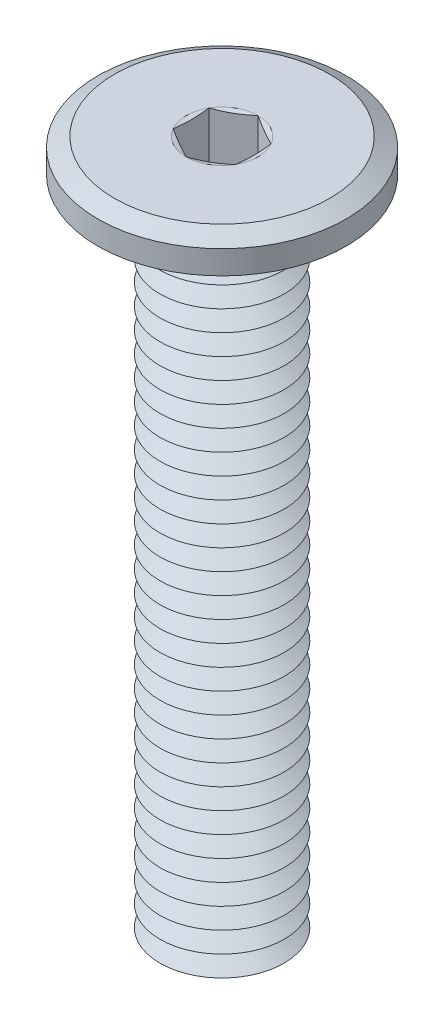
from build123d import *

# Parameters (mm, degrees)
SKETCH1_R           = 3
BOSS_EXTRUDE1_DEPTH = 0.8
SKETCH2_R           = 1.5
BOSS_EXTRUDE2_DEPTH = 16
LPATTERN1_COUNT     = 31
LPATTERN1_PITCH     = 0.5
FILLET1_R           = 0.1
CHAMFER2_SIZE       = 0.4
CHAMFER2_SIZE2      = 0.230940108
CUT_EXTRUDE1_DEPTH  = 1.4


with BuildPart() as part:
    # Sketch1 → Boss-Extrude1 (new body)
    with BuildSketch(Plane(origin=(0, 0, 0), x_dir=(1, 0, 0), z_dir=(0, 1, 0))):
        with Locations(Location((0, 0, 0), (0, 0, 270))):
            Circle(SKETCH1_R)
    extrude(amount=-BOSS_EXTRUDE1_DEPTH)

    # Sketch2 → Boss-Extrude2 (add)
    with BuildSketch(Plane.XZ.offset(0.8)):
        with Locations(Location((0, 0, 0), (0, 0, 270))):
            Circle(SKETCH2_R)
    extrude(amount=BOSS_EXTRUDE2_DEPTH)

    # Sketch5 → Cut-Revolve1 (revolve, cut)
    with BuildSketch(Plane(origin=(0, 0, 0), x_dir=(0, 0, -1), z_dir=(1, 0, 0))):
        Polygon((-1.5, -17.05), (-1.066987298, -16.8), (-1.5, -16.55), align=None)
    cut_revolve1 = revolve(axis=Axis((0, 0.990593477, 0), (0, -1, 0)), mode=Mode.SUBTRACT)

    # LPattern1: Cut-Revolve1 ×31
    with Locations(*[(0, i * LPATTERN1_PITCH, 0) for i in range(1, LPATTERN1_COUNT)]):
        add(cut_revolve1, mode=Mode.SUBTRACT)

    # Fillet1
    fillet1_edges = [part.edges().sort_by_distance(p)[0] for p in [
        (0, -0.8, 1.5),
    ]]
    fillet(fillet1_edges, radius=FILLET1_R)

    # Chamfer2
    chamfer2_edges = [part.edges().sort_by_distance(p)[0] for p in [
        (0, 0, -3),
    ]]
    chamfer2_side = [part.faces().sort_by_distance(p)[0] for p in [
        (0, 0, 0),
    ]]
    chamfer(chamfer2_edges, length=CHAMFER2_SIZE, length2=CHAMFER2_SIZE2, reference=chamfer2_side[0])

    # Sketch6 → Cut-Extrude1 (cut)
    with BuildSketch(Plane(origin=(0, 0, 0), x_dir=(1, 0, 0), z_dir=(0, 1, 0))):
        Polygon((0, 0.866025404), (-0.75, 0.433012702), (-0.75, -0.433012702), (0, -0.866025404), (0.75, -0.433012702), (0.75, 0.433012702), align=None)
    extrude(amount=-CUT_EXTRUDE1_DEPTH, mode=Mode.SUBTRACT)

    # Cut-Extrude2 cone 1 section (on through the dimple's axis) → Cut-Extrude2 (revolve, cut)
    with BuildSketch(Plane(origin=(0, -1.4, 0), x_dir=(0, 0, 1), z_dir=(1, 0, 0))):
        Polygon((0, 0), (0.75, 0), (0, 0.433012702), align=None)
    revolve(axis=Axis((0, -1.4, 0), (0, -1, 0)), mode=Mode.SUBTRACT)

    # Cut-Extrude3 cone 1 section (on through the dimple's axis) → Cut-Extrude3 (revolve, cut)
    with BuildSketch(Plane(origin=(0, 0, 0), x_dir=(0, 0, 1), z_dir=(1, 0, 0))):
        Polygon((0, 0), (0.866025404, 0), (0, 0.232050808), align=None)
    revolve(axis=Axis((0, 0, 0), (0, -1, 0)), mode=Mode.SUBTRACT)


solid = part.part
